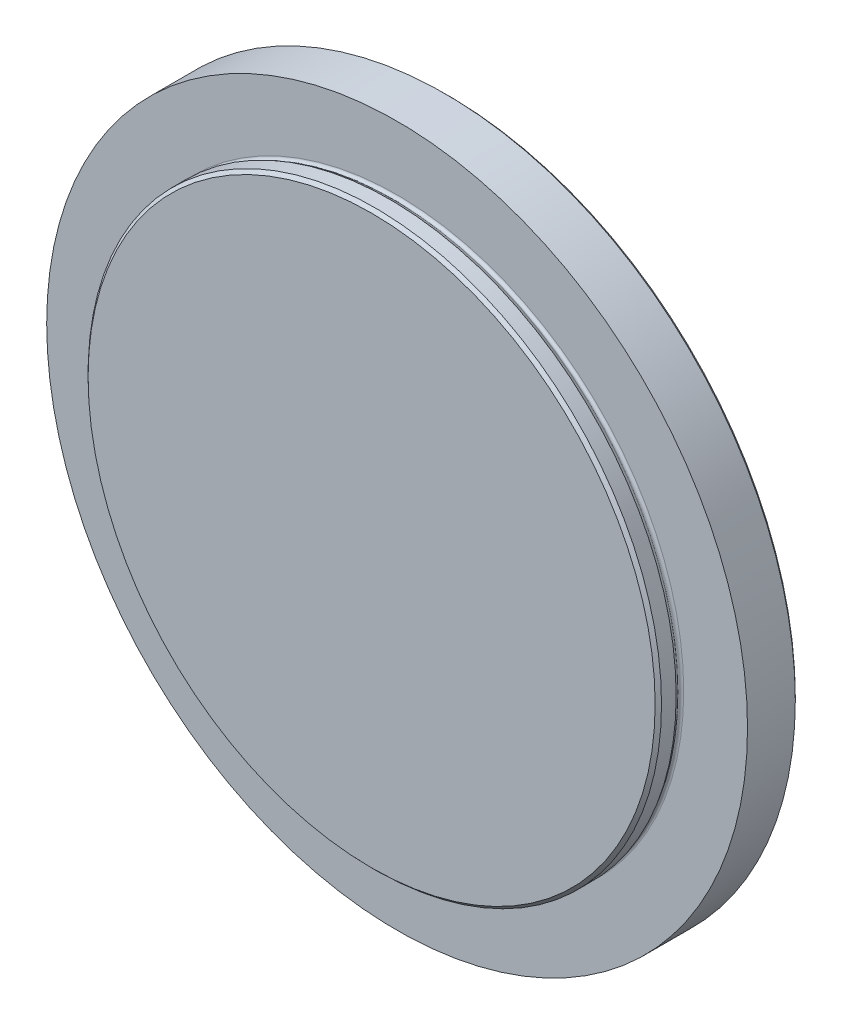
ISO-10303-21;
HEADER;
FILE_DESCRIPTION(('STEP AP214'),'2;1');
FILE_NAME('part.step','',(''),(''),'','','');
FILE_SCHEMA(('AUTOMOTIVE_DESIGN { 1 0 10303 214 1 1 1 1 }'));
ENDSEC;
DATA;
#1=APPLICATION_CONTEXT('core data for automotive mechanical design processes');
#2=APPLICATION_PROTOCOL_DEFINITION('international standard','automotive_design',2000,#1);
#3=PRODUCT_CONTEXT('',#1,'mechanical');
#4=PRODUCT('Part','Part','',(#3));
#5=PRODUCT_RELATED_PRODUCT_CATEGORY('part','',(#4));
#6=PRODUCT_DEFINITION_FORMATION('','',#4);
#7=PRODUCT_DEFINITION_CONTEXT('part definition',#1,'design');
#8=PRODUCT_DEFINITION('design','',#6,#7);
#9=PRODUCT_DEFINITION_SHAPE('','',#8);
#10=(LENGTH_UNIT() NAMED_UNIT(*) SI_UNIT(.MILLI.,.METRE.));
#11=(NAMED_UNIT(*) PLANE_ANGLE_UNIT() SI_UNIT($,.RADIAN.));
#12=(NAMED_UNIT(*) SI_UNIT($,.STERADIAN.) SOLID_ANGLE_UNIT());
#13=UNCERTAINTY_MEASURE_WITH_UNIT(LENGTH_MEASURE(1.E-05),#10,'distance_accuracy_value','');
#14=(GEOMETRIC_REPRESENTATION_CONTEXT(3) GLOBAL_UNCERTAINTY_ASSIGNED_CONTEXT((#13)) GLOBAL_UNIT_ASSIGNED_CONTEXT((#10,
#11,#12)) REPRESENTATION_CONTEXT('',''));
#15=CARTESIAN_POINT('',(0.,0.,0.));
#16=DIRECTION('',(0.,0.,1.));
#17=DIRECTION('',(1.,0.,0.));
#18=AXIS2_PLACEMENT_3D('',#15,#16,#17);
#19=CARTESIAN_POINT('',(0.,45.,0.));
#20=DIRECTION('',(0.,0.,-1.));
#21=DIRECTION('',(-1.,0.,0.));
#22=AXIS2_PLACEMENT_3D('',#19,#20,#21);
#23=PLANE('',#22);
#24=CARTESIAN_POINT('',(0.,0.,0.));
#25=DIRECTION('',(0.,0.,1.));
#26=DIRECTION('',(1.,0.,0.));
#27=AXIS2_PLACEMENT_3D('',#24,#25,#26);
#28=CIRCLE('',#27,55.);
#29=CARTESIAN_POINT('',(55.,0.,0.));
#30=VERTEX_POINT('',#29);
#31=EDGE_CURVE('E43',#30,#30,#28,.T.);
#32=ORIENTED_EDGE('',*,*,#31,.T.);
#33=EDGE_LOOP('',(#32));
#34=FACE_BOUND('',#33,.T.);
#35=CARTESIAN_POINT('',(0.,0.,0.));
#36=DIRECTION('',(0.,0.,1.));
#37=DIRECTION('',(1.,0.,0.));
#38=AXIS2_PLACEMENT_3D('',#35,#36,#37);
#39=CIRCLE('',#38,44.9859648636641);
#40=CARTESIAN_POINT('',(44.9859648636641,0.,0.));
#41=VERTEX_POINT('',#40);
#42=EDGE_CURVE('E55',#41,#41,#39,.T.);
#43=ORIENTED_EDGE('',*,*,#42,.F.);
#44=EDGE_LOOP('',(#43));
#45=FACE_BOUND('',#44,.T.);
#46=ADVANCED_FACE('F32',(#34,#45),#23,.F.);
#47=CARTESIAN_POINT('',(0.,0.,-8.));
#48=DIRECTION('',(0.,0.,1.));
#49=DIRECTION('',(1.,0.,0.));
#50=AXIS2_PLACEMENT_3D('',#47,#48,#49);
#51=CYLINDRICAL_SURFACE('',#50,55.);
#52=ORIENTED_EDGE('',*,*,#31,.F.);
#53=EDGE_LOOP('',(#52));
#54=FACE_BOUND('',#53,.T.);
#55=CARTESIAN_POINT('',(0.,0.,-7.49999999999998));
#56=DIRECTION('',(0.,0.,1.));
#57=DIRECTION('',(1.,0.,0.));
#58=AXIS2_PLACEMENT_3D('',#55,#56,#57);
#59=CIRCLE('',#58,55.);
#60=CARTESIAN_POINT('',(55.,0.,-7.49999999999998));
#61=VERTEX_POINT('',#60);
#62=EDGE_CURVE('E47',#61,#61,#59,.T.);
#63=ORIENTED_EDGE('',*,*,#62,.T.);
#64=EDGE_LOOP('',(#63));
#65=FACE_BOUND('',#64,.T.);
#66=ADVANCED_FACE('F81',(#54,#65),#51,.T.);
#67=CARTESIAN_POINT('',(0.,0.,-7.99999999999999));
#68=DIRECTION('',(0.,0.,1.));
#69=DIRECTION('',(1.,0.,0.));
#70=AXIS2_PLACEMENT_3D('',#67,#68,#69);
#71=CONICAL_SURFACE('',#70,54.5,0.785398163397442);
#72=ORIENTED_EDGE('',*,*,#62,.F.);
#73=EDGE_LOOP('',(#72));
#74=FACE_BOUND('',#73,.T.);
#75=CARTESIAN_POINT('',(0.,0.,-7.99999999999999));
#76=DIRECTION('',(0.,0.,1.));
#77=DIRECTION('',(1.,0.,0.));
#78=AXIS2_PLACEMENT_3D('',#75,#76,#77);
#79=CIRCLE('',#78,54.5);
#80=CARTESIAN_POINT('',(54.5,0.,-7.99999999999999));
#81=VERTEX_POINT('',#80);
#82=EDGE_CURVE('E52',#81,#81,#79,.T.);
#83=ORIENTED_EDGE('',*,*,#82,.T.);
#84=EDGE_LOOP('',(#83));
#85=FACE_BOUND('',#84,.T.);
#86=ADVANCED_FACE('F87',(#74,#85),#71,.T.);
#87=CARTESIAN_POINT('',(0.,0.,-8.));
#88=DIRECTION('',(0.,0.,1.));
#89=DIRECTION('',(1.,0.,0.));
#90=AXIS2_PLACEMENT_3D('',#87,#88,#89);
#91=PLANE('',#90);
#92=ORIENTED_EDGE('',*,*,#82,.F.);
#93=EDGE_LOOP('',(#92));
#94=FACE_BOUND('',#93,.T.);
#95=ADVANCED_FACE('F77',(#94),#91,.F.);
#96=CARTESIAN_POINT('',(0.,0.,0.400000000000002));
#97=DIRECTION('',(0.,0.,1.));
#98=DIRECTION('',(1.,0.,0.));
#99=AXIS2_PLACEMENT_3D('',#96,#97,#98);
#100=TOROIDAL_SURFACE('',#99,44.9859648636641,0.400000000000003);
#101=ORIENTED_EDGE('',*,*,#42,.T.);
#102=EDGE_LOOP('',(#101));
#103=FACE_BOUND('',#102,.T.);
#104=CARTESIAN_POINT('',(0.,0.,0.606015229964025));
#105=DIRECTION('',(0.,0.,1.));
#106=DIRECTION('',(1.,0.,0.));
#107=AXIS2_PLACEMENT_3D('',#104,#105,#106);
#108=CIRCLE('',#107,44.6430979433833);
#109=CARTESIAN_POINT('',(44.6430979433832,0.,0.606015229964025));
#110=VERTEX_POINT('',#109);
#111=EDGE_CURVE('E58',#110,#110,#108,.T.);
#112=ORIENTED_EDGE('',*,*,#111,.F.);
#113=EDGE_LOOP('',(#112));
#114=FACE_BOUND('',#113,.T.);
#115=ADVANCED_FACE('F69',(#103,#114),#100,.F.);
#116=CARTESIAN_POINT('',(0.,0.,1.2));
#117=DIRECTION('',(0.,0.,1.));
#118=DIRECTION('',(1.,0.,0.));
#119=AXIS2_PLACEMENT_3D('',#116,#117,#118);
#120=CONICAL_SURFACE('',#119,45.,0.541052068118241);
#121=ORIENTED_EDGE('',*,*,#111,.T.);
#122=EDGE_LOOP('',(#121));
#123=FACE_BOUND('',#122,.T.);
#124=CARTESIAN_POINT('',(0.,0.,1.2));
#125=DIRECTION('',(0.,0.,1.));
#126=DIRECTION('',(1.,0.,0.));
#127=AXIS2_PLACEMENT_3D('',#124,#125,#126);
#128=CIRCLE('',#127,45.);
#129=CARTESIAN_POINT('',(45.,0.,1.2));
#130=VERTEX_POINT('',#129);
#131=EDGE_CURVE('E61',#130,#130,#128,.T.);
#132=ORIENTED_EDGE('',*,*,#131,.F.);
#133=EDGE_LOOP('',(#132));
#134=FACE_BOUND('',#133,.T.);
#135=ADVANCED_FACE('F67',(#123,#134),#120,.T.);
#136=CARTESIAN_POINT('',(0.,44.5,4.));
#137=DIRECTION('',(0.,0.,-1.));
#138=DIRECTION('',(-1.,0.,0.));
#139=AXIS2_PLACEMENT_3D('',#136,#137,#138);
#140=PLANE('',#139);
#141=CARTESIAN_POINT('',(0.,0.,4.));
#142=DIRECTION('',(0.,0.,1.));
#143=DIRECTION('',(1.,0.,0.));
#144=AXIS2_PLACEMENT_3D('',#141,#142,#143);
#145=CIRCLE('',#144,44.5);
#146=CARTESIAN_POINT('',(44.5,0.,4.));
#147=VERTEX_POINT('',#146);
#148=EDGE_CURVE('E39',#147,#147,#145,.T.);
#149=ORIENTED_EDGE('',*,*,#148,.T.);
#150=EDGE_LOOP('',(#149));
#151=FACE_BOUND('',#150,.T.);
#152=ADVANCED_FACE('F34',(#151),#140,.F.);
#153=CARTESIAN_POINT('',(0.,0.,3.49999999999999));
#154=DIRECTION('',(0.,0.,-1.));
#155=DIRECTION('',(-1.,0.,0.));
#156=AXIS2_PLACEMENT_3D('',#153,#154,#155);
#157=CONICAL_SURFACE('',#156,45.,0.785398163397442);
#158=ORIENTED_EDGE('',*,*,#148,.F.);
#159=EDGE_LOOP('',(#158));
#160=FACE_BOUND('',#159,.T.);
#161=CARTESIAN_POINT('',(0.,0.,3.49999999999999));
#162=DIRECTION('',(0.,0.,1.));
#163=DIRECTION('',(1.,0.,0.));
#164=AXIS2_PLACEMENT_3D('',#161,#162,#163);
#165=CIRCLE('',#164,45.);
#166=CARTESIAN_POINT('',(45.,0.,3.49999999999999));
#167=VERTEX_POINT('',#166);
#168=EDGE_CURVE('E10',#167,#167,#165,.T.);
#169=ORIENTED_EDGE('',*,*,#168,.T.);
#170=EDGE_LOOP('',(#169));
#171=FACE_BOUND('',#170,.T.);
#172=ADVANCED_FACE('F76',(#160,#171),#157,.T.);
#173=CARTESIAN_POINT('',(0.,0.,-8.));
#174=DIRECTION('',(0.,0.,1.));
#175=DIRECTION('',(1.,0.,0.));
#176=AXIS2_PLACEMENT_3D('',#173,#174,#175);
#177=CYLINDRICAL_SURFACE('',#176,45.);
#178=ORIENTED_EDGE('',*,*,#168,.F.);
#179=EDGE_LOOP('',(#178));
#180=FACE_BOUND('',#179,.T.);
#181=ORIENTED_EDGE('',*,*,#131,.T.);
#182=EDGE_LOOP('',(#181));
#183=FACE_BOUND('',#182,.T.);
#184=ADVANCED_FACE('F65',(#180,#183),#177,.T.);
#185=CLOSED_SHELL('',(#46,#66,#86,#95,#115,#135,#152,#172,#184));
#186=MANIFOLD_SOLID_BREP('B2',#185);
#187=ADVANCED_BREP_SHAPE_REPRESENTATION('',(#18,#186),#14);
#188=SHAPE_DEFINITION_REPRESENTATION(#9,#187);
ENDSEC;
END-ISO-10303-21;
